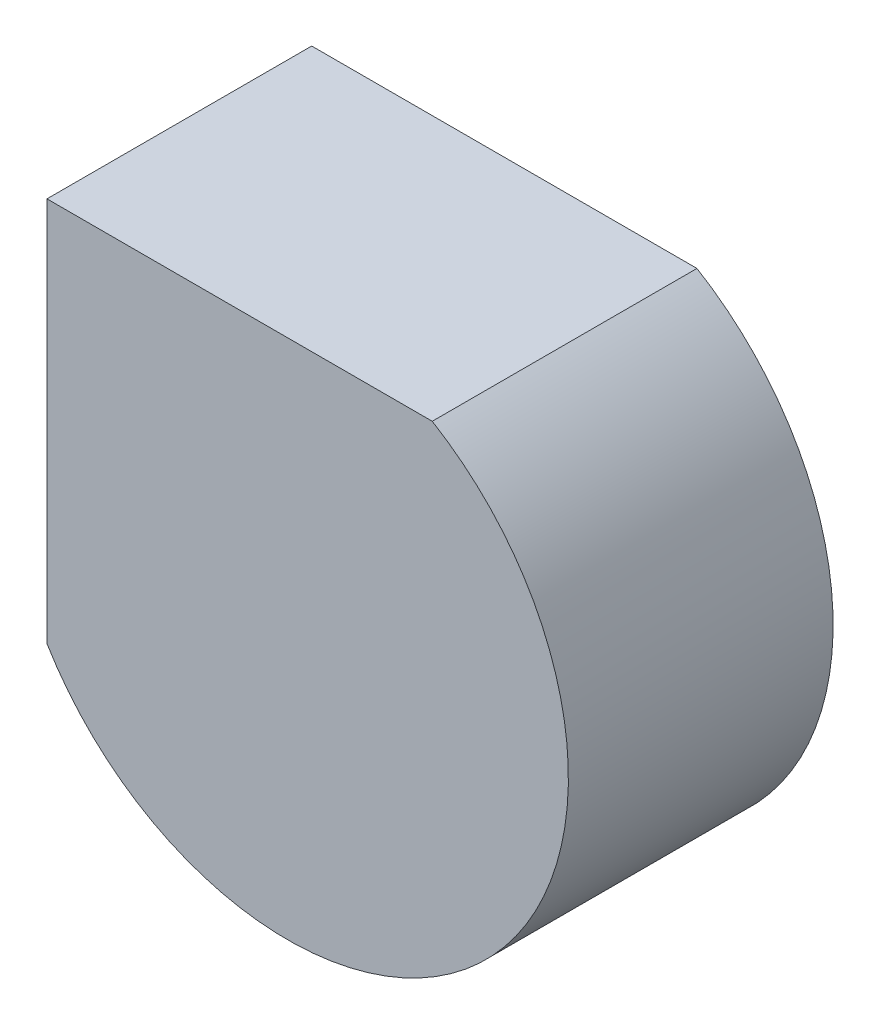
ISO-10303-21;
HEADER;
FILE_DESCRIPTION(('STEP AP214'),'2;1');
FILE_NAME('part.step','',(''),(''),'','','');
FILE_SCHEMA(('AUTOMOTIVE_DESIGN { 1 0 10303 214 1 1 1 1 }'));
ENDSEC;
DATA;
#1=APPLICATION_CONTEXT('core data for automotive mechanical design processes');
#2=APPLICATION_PROTOCOL_DEFINITION('international standard','automotive_design',2000,#1);
#3=PRODUCT_CONTEXT('',#1,'mechanical');
#4=PRODUCT('Part','Part','',(#3));
#5=PRODUCT_RELATED_PRODUCT_CATEGORY('part','',(#4));
#6=PRODUCT_DEFINITION_FORMATION('','',#4);
#7=PRODUCT_DEFINITION_CONTEXT('part definition',#1,'design');
#8=PRODUCT_DEFINITION('design','',#6,#7);
#9=PRODUCT_DEFINITION_SHAPE('','',#8);
#10=(LENGTH_UNIT() NAMED_UNIT(*) SI_UNIT(.MILLI.,.METRE.));
#11=(NAMED_UNIT(*) PLANE_ANGLE_UNIT() SI_UNIT($,.RADIAN.));
#12=(NAMED_UNIT(*) SI_UNIT($,.STERADIAN.) SOLID_ANGLE_UNIT());
#13=UNCERTAINTY_MEASURE_WITH_UNIT(LENGTH_MEASURE(1.E-05),#10,'distance_accuracy_value','');
#14=(GEOMETRIC_REPRESENTATION_CONTEXT(3) GLOBAL_UNCERTAINTY_ASSIGNED_CONTEXT((#13)) GLOBAL_UNIT_ASSIGNED_CONTEXT((#10,
#11,#12)) REPRESENTATION_CONTEXT('',''));
#15=CARTESIAN_POINT('',(0.,0.,0.));
#16=DIRECTION('',(0.,0.,1.));
#17=DIRECTION('',(1.,0.,0.));
#18=AXIS2_PLACEMENT_3D('',#15,#16,#17);
#19=CARTESIAN_POINT('',(0.,0.,0.));
#20=DIRECTION('',(0.,0.,-1.));
#21=DIRECTION('',(-1.,0.,0.));
#22=AXIS2_PLACEMENT_3D('',#19,#20,#21);
#23=CONICAL_SURFACE('',#22,25.,0.0349065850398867);
#24=CARTESIAN_POINT('',(0.,0.,-0.1930201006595));
#25=DIRECTION('',(0.,0.,-1.));
#26=DIRECTION('',(-1.,0.,0.));
#27=AXIS2_PLACEMENT_3D('',#24,#25,#26);
#28=CIRCLE('',#27,25.0067404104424);
#29=CARTESIAN_POINT('',(-25.0067404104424,0.,-0.1930201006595));
#30=VERTEX_POINT('',#29);
#31=EDGE_CURVE('E166',#30,#30,#28,.F.);
#32=ORIENTED_EDGE('',*,*,#31,.T.);
#33=EDGE_LOOP('',(#32));
#34=FACE_BOUND('',#33,.T.);
#35=CARTESIAN_POINT('',(0.,0.,-3.));
#36=DIRECTION('',(0.,0.,-1.));
#37=DIRECTION('',(-1.,0.,0.));
#38=AXIS2_PLACEMENT_3D('',#35,#36,#37);
#39=CIRCLE('',#38,25.1047623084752);
#40=CARTESIAN_POINT('',(13.1531404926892,21.3832641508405,-3.));
#41=VERTEX_POINT('',#40);
#42=CARTESIAN_POINT('',(24.1239990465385,6.9485077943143,-3.));
#43=VERTEX_POINT('',#42);
#44=EDGE_CURVE('E84',#41,#43,#39,.F.);
#45=ORIENTED_EDGE('',*,*,#44,.F.);
#46=CARTESIAN_POINT('',(11.682794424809,22.2207426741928,-3.));
#47=CARTESIAN_POINT('',(11.746621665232,22.1880879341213,-3.02286542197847));
#48=CARTESIAN_POINT('',(11.8109198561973,22.1547574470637,-3.04372447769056));
#49=CARTESIAN_POINT('',(11.9404029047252,22.0866946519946,-3.08033358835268));
#50=CARTESIAN_POINT('',(12.0055894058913,22.0519594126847,-3.09607226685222));
#51=CARTESIAN_POINT('',(12.134684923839,21.9821680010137,-3.1208825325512));
#52=CARTESIAN_POINT('',(12.1985788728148,21.9471477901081,-3.13012780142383));
#53=CARTESIAN_POINT('',(12.326362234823,21.876106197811,-3.14188607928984));
#54=CARTESIAN_POINT('',(12.3902515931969,21.8400858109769,-3.1444055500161));
#55=CARTESIAN_POINT('',(12.5183707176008,21.7668294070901,-3.14248914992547));
#56=CARTESIAN_POINT('',(12.5825934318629,21.7295835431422,-3.1379589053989));
#57=CARTESIAN_POINT('',(12.709972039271,21.6546854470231,-3.12217638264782));
#58=CARTESIAN_POINT('',(12.7731275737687,21.6170330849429,-3.11092188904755));
#59=CARTESIAN_POINT('',(12.8985857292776,21.5412535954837,-3.08246866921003));
#60=CARTESIAN_POINT('',(12.960875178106,21.5031252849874,-3.06521626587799));
#61=CARTESIAN_POINT('',(13.083879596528,21.4268965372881,-3.02593826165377));
#62=CARTESIAN_POINT('',(13.1445951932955,21.38879609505,-3.00391459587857));
#63=CARTESIAN_POINT('',(13.3311290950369,21.2703912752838,-2.92981694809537));
#64=CARTESIAN_POINT('',(13.4544645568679,21.1901470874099,-2.87150602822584));
#65=CARTESIAN_POINT('',(13.6968859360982,21.0290870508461,-2.74723216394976));
#66=CARTESIAN_POINT('',(13.8159651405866,20.9482705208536,-2.6812577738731));
#67=CARTESIAN_POINT('',(14.0523537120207,20.7847766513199,-2.54688866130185));
#68=CARTESIAN_POINT('',(14.1696534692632,20.7020928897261,-2.47848488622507));
#69=CARTESIAN_POINT('',(14.4033903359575,20.5343915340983,-2.34332399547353));
#70=CARTESIAN_POINT('',(14.5198279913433,20.4493756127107,-2.2765657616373));
#71=CARTESIAN_POINT('',(14.751890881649,20.2770428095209,-2.14796696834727));
#72=CARTESIAN_POINT('',(14.8675144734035,20.1897520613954,-2.08608899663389));
#73=CARTESIAN_POINT('',(15.0994888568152,20.0117247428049,-1.96879740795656));
#74=CARTESIAN_POINT('',(15.2158398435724,19.9209872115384,-1.91338561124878));
#75=CARTESIAN_POINT('',(15.4490249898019,19.7361589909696,-1.81112098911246));
#76=CARTESIAN_POINT('',(15.5658565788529,19.6420794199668,-1.76424247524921));
#77=CARTESIAN_POINT('',(15.8001523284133,19.4503436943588,-1.68058098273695));
#78=CARTESIAN_POINT('',(15.9176161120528,19.3526895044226,-1.64379255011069));
#79=CARTESIAN_POINT('',(16.1032411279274,19.1958703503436,-1.59490584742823));
#80=CARTESIAN_POINT('',(16.171333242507,19.1378151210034,-1.57893421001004));
#81=CARTESIAN_POINT('',(16.3074864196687,19.0206542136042,-1.55116889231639));
#82=CARTESIAN_POINT('',(16.3755474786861,18.9615484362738,-1.53937560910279));
#83=CARTESIAN_POINT('',(16.5129248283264,18.8411432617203,-1.52003372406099));
#84=CARTESIAN_POINT('',(16.5822371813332,18.7798239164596,-1.51258029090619));
#85=CARTESIAN_POINT('',(16.7205022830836,18.6563582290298,-1.50256038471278));
#86=CARTESIAN_POINT('',(16.7894549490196,18.5942117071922,-1.49999499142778));
#87=CARTESIAN_POINT('',(16.8581285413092,18.531737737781,-1.5));
#88=B_SPLINE_CURVE_WITH_KNOTS('',3,(#46,#47,#48,#49,#50,#51,#52,#53,#54,#55,#56,#57,#58,#59,#60,
#61,#62,#63,#64,#65,#66,#67,#68,#69,#70,#71,#72,#73,#74,#75,#76,#77,#78,#79,#80,#81,#82,#83,#84,
#85,#86,#87),.UNSPECIFIED.,.F.,.F.,(4,2,2,2,2,2,2,2,2,2,2,2,2,2,2,2,2,2,2,2,4),(0.,
0.225856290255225,0.452211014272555,0.672253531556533,0.892084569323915,1.11488387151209,
1.337756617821,1.56267756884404,1.78750746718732,2.26170212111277,2.7366143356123,
3.21353416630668,3.69012045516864,4.16260080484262,4.63521384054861,5.10637971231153,
5.57729040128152,5.8498898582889,6.12251521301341,6.40091339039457,6.67937305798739),.UNSPECIFIED.);
#89=CARTESIAN_POINT('',(16.8581285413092,18.531737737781,-1.5));
#90=VERTEX_POINT('',#89);
#91=EDGE_CURVE('E79',#41,#90,#88,.T.);
#92=ORIENTED_EDGE('',*,*,#91,.T.);
#93=CARTESIAN_POINT('',(0.,0.,-1.5));
#94=DIRECTION('',(0.,0.,-1.));
#95=DIRECTION('',(-1.,0.,0.));
#96=AXIS2_PLACEMENT_3D('',#93,#94,#95);
#97=CIRCLE('',#96,25.0523811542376);
#98=CARTESIAN_POINT('',(22.3684212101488,11.2816458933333,-1.5));
#99=VERTEX_POINT('',#98);
#100=EDGE_CURVE('E81',#99,#90,#97,.F.);
#101=ORIENTED_EDGE('',*,*,#100,.F.);
#102=CARTESIAN_POINT('',(21.9629374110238,12.05780533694,-1.5797166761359));
#103=CARTESIAN_POINT('',(22.0193579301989,11.9534413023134,-1.55751131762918));
#104=CARTESIAN_POINT('',(22.0755840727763,11.8479968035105,-1.5400859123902));
#105=CARTESIAN_POINT('',(22.187210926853,11.635679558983,-1.51445692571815));
#106=CARTESIAN_POINT('',(22.2426123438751,11.5288082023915,-1.50624495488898));
#107=CARTESIAN_POINT('',(22.3512303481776,11.3161876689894,-1.4987365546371));
#108=CARTESIAN_POINT('',(22.404468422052,11.2104549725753,-1.49927599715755));
#109=CARTESIAN_POINT('',(22.5095615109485,10.9986431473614,-1.50841620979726));
#110=CARTESIAN_POINT('',(22.5614162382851,10.8925639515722,-1.51701864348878));
#111=CARTESIAN_POINT('',(22.6916178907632,10.6221719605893,-1.54858778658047));
#112=CARTESIAN_POINT('',(22.7688469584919,10.4579244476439,-1.57685301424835));
#113=CARTESIAN_POINT('',(22.9189654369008,10.1309670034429,-1.64929594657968));
#114=CARTESIAN_POINT('',(22.9918527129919,9.9682578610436,-1.69348140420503));
#115=CARTESIAN_POINT('',(23.1340449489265,9.64300364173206,-1.79589167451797));
#116=CARTESIAN_POINT('',(23.2032899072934,9.48048909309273,-1.85429414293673));
#117=CARTESIAN_POINT('',(23.3372599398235,9.15794950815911,-1.98188353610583));
#118=CARTESIAN_POINT('',(23.4019855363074,8.99792418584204,-2.05106921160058));
#119=CARTESIAN_POINT('',(23.5267127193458,8.68119522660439,-2.19625490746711));
#120=CARTESIAN_POINT('',(23.5867522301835,8.52447458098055,-2.27218651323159));
#121=CARTESIAN_POINT('',(23.6741520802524,8.28969321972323,-2.38859651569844));
#122=CARTESIAN_POINT('',(23.7028406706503,8.21148685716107,-2.42781646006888));
#123=CARTESIAN_POINT('',(23.7594143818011,8.05488690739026,-2.50646191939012));
#124=CARTESIAN_POINT('',(23.7872995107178,7.9764933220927,-2.5458874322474));
#125=CARTESIAN_POINT('',(23.841762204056,7.8208636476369,-2.62336249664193));
#126=CARTESIAN_POINT('',(23.8683549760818,7.74363861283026,-2.66142344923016));
#127=CARTESIAN_POINT('',(23.9209217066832,7.58832960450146,-2.73613457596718));
#128=CARTESIAN_POINT('',(23.9468958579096,7.51024590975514,-2.77278519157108));
#129=CARTESIAN_POINT('',(23.9983392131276,7.35265725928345,-2.84364020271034));
#130=CARTESIAN_POINT('',(24.0238077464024,7.27315065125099,-2.87784148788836));
#131=CARTESIAN_POINT('',(24.0742646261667,7.11229572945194,-2.94228392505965));
#132=CARTESIAN_POINT('',(24.0992523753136,7.03094536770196,-2.9725203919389));
#133=CARTESIAN_POINT('',(24.1239990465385,6.9485077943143,-3.));
#134=B_SPLINE_CURVE_WITH_KNOTS('',3,(#102,#103,#104,#105,#106,#107,#108,#109,#110,#111,#112,
#113,#114,#115,#116,#117,#118,#119,#120,#121,#122,#123,#124,#125,#126,#127,#128,#129,#130,#131,
#132,#133),.UNSPECIFIED.,.F.,.F.,(4,2,2,2,2,2,2,2,2,2,2,2,2,2,2,4),(0.,0.361945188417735,
0.723560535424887,1.0784019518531,1.4333165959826,1.98346346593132,2.53387861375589,
3.0915607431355,3.64917831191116,4.20167498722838,4.47789390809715,4.7541100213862,
5.02442471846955,5.29465410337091,5.56522077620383,5.83610434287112),.UNSPECIFIED.);
#135=EDGE_CURVE('E88',#99,#43,#134,.T.);
#136=ORIENTED_EDGE('',*,*,#135,.T.);
#137=EDGE_LOOP('',(#45,#92,#101,#136));
#138=FACE_BOUND('',#137,.T.);
#139=ADVANCED_FACE('F44',(#34,#138),#23,.F.);
#140=CARTESIAN_POINT('',(0.,0.,0.));
#141=DIRECTION('',(0.,0.,1.));
#142=DIRECTION('',(1.,0.,0.));
#143=AXIS2_PLACEMENT_3D('',#140,#141,#142);
#144=PLANE('',#143);
#145=CARTESIAN_POINT('',(-12.0208152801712,-12.0208152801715,0.));
#146=DIRECTION('',(0.,0.,1.));
#147=DIRECTION('',(1.,0.,0.));
#148=AXIS2_PLACEMENT_3D('',#145,#146,#147);
#149=CIRCLE('',#148,3.04138126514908);
#150=CARTESIAN_POINT('',(-8.97943401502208,-12.0208152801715,0.));
#151=VERTEX_POINT('',#150);
#152=EDGE_CURVE('E53',#151,#151,#149,.T.);
#153=ORIENTED_EDGE('',*,*,#152,.T.);
#154=EDGE_LOOP('',(#153));
#155=FACE_BOUND('',#154,.T.);
#156=CARTESIAN_POINT('',(-17.,-1.78065548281E-13,0.));
#157=DIRECTION('',(0.,0.,1.));
#158=DIRECTION('',(1.,0.,0.));
#159=AXIS2_PLACEMENT_3D('',#156,#157,#158);
#160=CIRCLE('',#159,3.04138126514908);
#161=CARTESIAN_POINT('',(-13.9586187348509,-1.78065548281E-13,0.));
#162=VERTEX_POINT('',#161);
#163=EDGE_CURVE('E205',#162,#162,#160,.T.);
#164=ORIENTED_EDGE('',*,*,#163,.T.);
#165=EDGE_LOOP('',(#164));
#166=FACE_BOUND('',#165,.T.);
#167=CARTESIAN_POINT('',(-12.0208152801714,12.0208152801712,0.));
#168=DIRECTION('',(0.,0.,1.));
#169=DIRECTION('',(1.,0.,0.));
#170=AXIS2_PLACEMENT_3D('',#167,#168,#169);
#171=CIRCLE('',#170,3.04138126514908);
#172=CARTESIAN_POINT('',(-8.97943401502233,12.0208152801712,0.));
#173=VERTEX_POINT('',#172);
#174=EDGE_CURVE('E199',#173,#173,#171,.T.);
#175=ORIENTED_EDGE('',*,*,#174,.T.);
#176=EDGE_LOOP('',(#175));
#177=FACE_BOUND('',#176,.T.);
#178=CARTESIAN_POINT('',(12.0208152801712,12.0208152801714,0.));
#179=DIRECTION('',(0.,0.,1.));
#180=DIRECTION('',(1.,0.,0.));
#181=AXIS2_PLACEMENT_3D('',#178,#179,#180);
#182=CIRCLE('',#181,3.04138126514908);
#183=CARTESIAN_POINT('',(15.0621965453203,12.0208152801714,0.));
#184=VERTEX_POINT('',#183);
#185=EDGE_CURVE('E193',#184,#184,#182,.T.);
#186=ORIENTED_EDGE('',*,*,#185,.T.);
#187=EDGE_LOOP('',(#186));
#188=FACE_BOUND('',#187,.T.);
#189=CARTESIAN_POINT('',(17.,0.,0.));
#190=DIRECTION('',(0.,0.,1.));
#191=DIRECTION('',(1.,0.,0.));
#192=AXIS2_PLACEMENT_3D('',#189,#190,#191);
#193=CIRCLE('',#192,3.04138126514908);
#194=CARTESIAN_POINT('',(20.0413812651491,0.,0.));
#195=VERTEX_POINT('',#194);
#196=EDGE_CURVE('E187',#195,#195,#193,.T.);
#197=ORIENTED_EDGE('',*,*,#196,.T.);
#198=EDGE_LOOP('',(#197));
#199=FACE_BOUND('',#198,.T.);
#200=CARTESIAN_POINT('',(12.0208152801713,-12.0208152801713,0.));
#201=DIRECTION('',(0.,0.,1.));
#202=DIRECTION('',(1.,0.,0.));
#203=AXIS2_PLACEMENT_3D('',#200,#201,#202);
#204=CIRCLE('',#203,3.04138126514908);
#205=CARTESIAN_POINT('',(15.0621965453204,-12.0208152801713,0.));
#206=VERTEX_POINT('',#205);
#207=EDGE_CURVE('E181',#206,#206,#204,.T.);
#208=ORIENTED_EDGE('',*,*,#207,.T.);
#209=EDGE_LOOP('',(#208));
#210=FACE_BOUND('',#209,.T.);
#211=CARTESIAN_POINT('',(0.,-17.,0.));
#212=DIRECTION('',(0.,0.,1.));
#213=DIRECTION('',(1.,0.,0.));
#214=AXIS2_PLACEMENT_3D('',#211,#212,#213);
#215=CIRCLE('',#214,3.04138126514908);
#216=CARTESIAN_POINT('',(3.04138126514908,-17.,0.));
#217=VERTEX_POINT('',#216);
#218=EDGE_CURVE('E175',#217,#217,#215,.T.);
#219=ORIENTED_EDGE('',*,*,#218,.T.);
#220=EDGE_LOOP('',(#219));
#221=FACE_BOUND('',#220,.T.);
#222=CARTESIAN_POINT('',(0.,0.,0.));
#223=DIRECTION('',(0.,0.,1.));
#224=DIRECTION('',(1.,0.,0.));
#225=AXIS2_PLACEMENT_3D('',#222,#223,#224);
#226=CIRCLE('',#225,24.8068622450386);
#227=CARTESIAN_POINT('',(24.8068622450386,0.,0.));
#228=VERTEX_POINT('',#227);
#229=EDGE_CURVE('E172',#228,#228,#226,.F.);
#230=ORIENTED_EDGE('',*,*,#229,.T.);
#231=EDGE_LOOP('',(#230));
#232=FACE_BOUND('',#231,.T.);
#233=CARTESIAN_POINT('',(0.,17.,0.));
#234=DIRECTION('',(0.,0.,1.));
#235=DIRECTION('',(1.,0.,0.));
#236=AXIS2_PLACEMENT_3D('',#233,#234,#235);
#237=CIRCLE('',#236,5.04313775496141);
#238=CARTESIAN_POINT('',(5.04313775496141,17.,0.));
#239=VERTEX_POINT('',#238);
#240=EDGE_CURVE('E169',#239,#239,#237,.T.);
#241=ORIENTED_EDGE('',*,*,#240,.T.);
#242=EDGE_LOOP('',(#241));
#243=FACE_BOUND('',#242,.T.);
#244=CARTESIAN_POINT('',(0.,0.,0.));
#245=DIRECTION('',(0.,0.,1.));
#246=DIRECTION('',(1.,0.,0.));
#247=AXIS2_PLACEMENT_3D('',#244,#245,#246);
#248=CIRCLE('',#247,11.9313775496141);
#249=CARTESIAN_POINT('',(11.9313775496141,0.,0.));
#250=VERTEX_POINT('',#249);
#251=EDGE_CURVE('E148',#250,#250,#248,.T.);
#252=ORIENTED_EDGE('',*,*,#251,.T.);
#253=EDGE_LOOP('',(#252));
#254=FACE_BOUND('',#253,.T.);
#255=ADVANCED_FACE('F137',(#155,#166,#177,#188,#199,#210,#221,#232,#243,#254),#144,.F.);
#256=CARTESIAN_POINT('',(0.,0.,0.));
#257=DIRECTION('',(0.,0.,1.));
#258=DIRECTION('',(-1.,0.,0.));
#259=AXIS2_PLACEMENT_3D('',#256,#257,#258);
#260=CONICAL_SURFACE('',#259,10.,0.0349065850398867);
#261=CARTESIAN_POINT('',(0.,0.,-1.930201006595));
#262=DIRECTION('',(0.,0.,1.));
#263=DIRECTION('',(1.,0.,0.));
#264=AXIS2_PLACEMENT_3D('',#261,#262,#263);
#265=CIRCLE('',#264,9.93259589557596);
#266=CARTESIAN_POINT('',(9.93259589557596,0.,-1.930201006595));
#267=VERTEX_POINT('',#266);
#268=EDGE_CURVE('E121',#267,#267,#265,.F.);
#269=ORIENTED_EDGE('',*,*,#268,.T.);
#270=EDGE_LOOP('',(#269));
#271=FACE_BOUND('',#270,.T.);
#272=CARTESIAN_POINT('',(0.,0.,-5.));
#273=DIRECTION('',(0.,0.,-1.));
#274=DIRECTION('',(-1.,0.,0.));
#275=AXIS2_PLACEMENT_3D('',#272,#273,#274);
#276=CIRCLE('',#275,9.82539615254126);
#277=CARTESIAN_POINT('',(-9.82539615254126,0.,-5.));
#278=VERTEX_POINT('',#277);
#279=EDGE_CURVE('E109',#278,#278,#276,.T.);
#280=ORIENTED_EDGE('',*,*,#279,.F.);
#281=EDGE_LOOP('',(#280));
#282=FACE_BOUND('',#281,.T.);
#283=ADVANCED_FACE('F233',(#271,#282),#260,.T.);
#284=CARTESIAN_POINT('',(0.,0.,-5.));
#285=DIRECTION('',(0.,0.,-1.));
#286=DIRECTION('',(-1.,0.,0.));
#287=AXIS2_PLACEMENT_3D('',#284,#285,#286);
#288=PLANE('',#287);
#289=ORIENTED_EDGE('',*,*,#279,.T.);
#290=EDGE_LOOP('',(#289));
#291=FACE_BOUND('',#290,.T.);
#292=ADVANCED_FACE('F302',(#291),#288,.T.);
#293=CARTESIAN_POINT('',(0.,17.,1.5));
#294=DIRECTION('',(0.,0.,1.));
#295=DIRECTION('',(1.,0.,0.));
#296=AXIS2_PLACEMENT_3D('',#293,#294,#295);
#297=PLANE('',#296);
#298=CARTESIAN_POINT('',(0.,17.,1.5));
#299=DIRECTION('',(0.,0.,1.));
#300=DIRECTION('',(1.,0.,0.));
#301=AXIS2_PLACEMENT_3D('',#298,#299,#300);
#302=CIRCLE('',#301,1.99551890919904);
#303=CARTESIAN_POINT('',(1.99551890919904,17.,1.5));
#304=VERTEX_POINT('',#303);
#305=EDGE_CURVE('E154',#304,#304,#302,.T.);
#306=ORIENTED_EDGE('',*,*,#305,.T.);
#307=EDGE_LOOP('',(#306));
#308=FACE_BOUND('',#307,.T.);
#309=CARTESIAN_POINT('',(0.,17.,1.5));
#310=DIRECTION('',(0.,0.,1.));
#311=DIRECTION('',(1.,0.,0.));
#312=AXIS2_PLACEMENT_3D('',#309,#310,#311);
#313=CIRCLE('',#312,4.60448109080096);
#314=CARTESIAN_POINT('',(4.60448109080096,17.,1.5));
#315=VERTEX_POINT('',#314);
#316=EDGE_CURVE('E151',#315,#315,#313,.F.);
#317=ORIENTED_EDGE('',*,*,#316,.T.);
#318=EDGE_LOOP('',(#317));
#319=FACE_BOUND('',#318,.T.);
#320=ADVANCED_FACE('F307',(#308,#319),#297,.F.);
#321=CARTESIAN_POINT('',(0.,17.,0.));
#322=DIRECTION('',(0.,0.,-1.));
#323=DIRECTION('',(-1.,0.,0.));
#324=AXIS2_PLACEMENT_3D('',#321,#322,#323);
#325=CONICAL_SURFACE('',#324,4.85,0.0349065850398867);
#326=CARTESIAN_POINT('',(0.,17.,1.3069798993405));
#327=DIRECTION('',(0.,0.,1.));
#328=DIRECTION('',(1.,0.,0.));
#329=AXIS2_PLACEMENT_3D('',#326,#327,#328);
#330=CIRCLE('',#329,4.80435925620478);
#331=CARTESIAN_POINT('',(4.80435925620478,17.,1.3069798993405));
#332=VERTEX_POINT('',#331);
#333=EDGE_CURVE('E163',#332,#332,#330,.T.);
#334=ORIENTED_EDGE('',*,*,#333,.T.);
#335=EDGE_LOOP('',(#334));
#336=FACE_BOUND('',#335,.T.);
#337=CARTESIAN_POINT('',(0.,17.,0.1930201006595));
#338=DIRECTION('',(0.,0.,-1.));
#339=DIRECTION('',(-1.,0.,0.));
#340=AXIS2_PLACEMENT_3D('',#337,#338,#339);
#341=CIRCLE('',#340,4.8432595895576);
#342=CARTESIAN_POINT('',(-4.8432595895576,17.,0.1930201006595));
#343=VERTEX_POINT('',#342);
#344=EDGE_CURVE('E160',#343,#343,#341,.T.);
#345=ORIENTED_EDGE('',*,*,#344,.T.);
#346=EDGE_LOOP('',(#345));
#347=FACE_BOUND('',#346,.T.);
#348=ADVANCED_FACE('F311',(#336,#347),#325,.F.);
#349=CARTESIAN_POINT('',(0.,17.,0.));
#350=DIRECTION('',(0.,0.,1.));
#351=DIRECTION('',(-1.,0.,0.));
#352=AXIS2_PLACEMENT_3D('',#349,#350,#351);
#353=CONICAL_SURFACE('',#352,1.75,0.0349065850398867);
#354=CARTESIAN_POINT('',(0.,17.,1.3069798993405));
#355=DIRECTION('',(0.,0.,1.));
#356=DIRECTION('',(1.,0.,0.));
#357=AXIS2_PLACEMENT_3D('',#354,#355,#356);
#358=CIRCLE('',#357,1.79564074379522);
#359=CARTESIAN_POINT('',(1.79564074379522,17.,1.3069798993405));
#360=VERTEX_POINT('',#359);
#361=EDGE_CURVE('E157',#360,#360,#358,.F.);
#362=ORIENTED_EDGE('',*,*,#361,.T.);
#363=EDGE_LOOP('',(#362));
#364=FACE_BOUND('',#363,.T.);
#365=CARTESIAN_POINT('',(0.,17.,-5.));
#366=DIRECTION('',(0.,0.,-1.));
#367=DIRECTION('',(-1.,0.,0.));
#368=AXIS2_PLACEMENT_3D('',#365,#366,#367);
#369=CIRCLE('',#368,1.57539615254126);
#370=CARTESIAN_POINT('',(-1.57539615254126,17.,-5.));
#371=VERTEX_POINT('',#370);
#372=EDGE_CURVE('E112',#371,#371,#369,.F.);
#373=ORIENTED_EDGE('',*,*,#372,.T.);
#374=EDGE_LOOP('',(#373));
#375=FACE_BOUND('',#374,.T.);
#376=ADVANCED_FACE('F319',(#364,#375),#353,.T.);
#377=CARTESIAN_POINT('',(0.,0.,-5.));
#378=DIRECTION('',(0.,0.,-1.));
#379=DIRECTION('',(-1.,0.,0.));
#380=AXIS2_PLACEMENT_3D('',#377,#378,#379);
#381=PLANE('',#380);
#382=ORIENTED_EDGE('',*,*,#372,.F.);
#383=EDGE_LOOP('',(#382));
#384=FACE_BOUND('',#383,.T.);
#385=ADVANCED_FACE('F315',(#384),#381,.T.);
#386=CARTESIAN_POINT('',(0.,0.,-3.));
#387=DIRECTION('',(0.,0.,-1.));
#388=DIRECTION('',(-1.,0.,0.));
#389=AXIS2_PLACEMENT_3D('',#386,#387,#388);
#390=PLANE('',#389);
#391=CARTESIAN_POINT('',(19.9037600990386,15.1274695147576,-3.));
#392=DIRECTION('',(0.,0.,-1.));
#393=DIRECTION('',(-1.,0.,0.));
#394=AXIS2_PLACEMENT_3D('',#391,#392,#393);
#395=CIRCLE('',#394,7.5);
#396=CARTESIAN_POINT('',(16.2836234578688,21.6959252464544,-3.));
#397=VERTEX_POINT('',#396);
#398=CARTESIAN_POINT('',(25.2633122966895,9.88102307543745,-3.));
#399=VERTEX_POINT('',#398);
#400=EDGE_CURVE('E108',#397,#399,#395,.T.);
#401=ORIENTED_EDGE('',*,*,#400,.F.);
#402=CARTESIAN_POINT('',(14.3528839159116,25.1991016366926,-3.));
#403=DIRECTION('',(0.,0.,-1.));
#404=DIRECTION('',(-1.,0.,0.));
#405=AXIS2_PLACEMENT_3D('',#402,#403,#404);
#406=CIRCLE('',#405,4.);
#407=EDGE_CURVE('E644',#397,#41,#406,.T.);
#408=ORIENTED_EDGE('',*,*,#407,.T.);
#409=ORIENTED_EDGE('',*,*,#44,.T.);
#410=CARTESIAN_POINT('',(28.1217401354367,7.08291830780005,-3.));
#411=DIRECTION('',(0.,0.,-1.));
#412=DIRECTION('',(-1.,0.,0.));
#413=AXIS2_PLACEMENT_3D('',#410,#411,#412);
#414=CIRCLE('',#413,4.);
#415=EDGE_CURVE('E93',#43,#399,#414,.T.);
#416=ORIENTED_EDGE('',*,*,#415,.T.);
#417=EDGE_LOOP('',(#401,#408,#409,#416));
#418=FACE_BOUND('',#417,.T.);
#419=CARTESIAN_POINT('',(0.,0.,-3.));
#420=DIRECTION('',(0.,0.,-1.));
#421=DIRECTION('',(-1.,0.,0.));
#422=AXIS2_PLACEMENT_3D('',#419,#420,#421);
#423=CIRCLE('',#422,35.);
#424=CARTESIAN_POINT('',(18.02775637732,30.,-3.));
#425=VERTEX_POINT('',#424);
#426=CARTESIAN_POINT('',(-30.,-18.02775637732,-3.));
#427=VERTEX_POINT('',#426);
#428=EDGE_CURVE('E621',#425,#427,#423,.T.);
#429=ORIENTED_EDGE('',*,*,#428,.T.);
#430=DIRECTION('',(0.,-1.,0.));
#431=VECTOR('',#430,1.);
#432=CARTESIAN_POINT('',(-30.,30.,-3.));
#433=LINE('',#432,#431);
#434=CARTESIAN_POINT('',(-30.,30.,-3.));
#435=VERTEX_POINT('',#434);
#436=EDGE_CURVE('E94',#435,#427,#433,.T.);
#437=ORIENTED_EDGE('',*,*,#436,.F.);
#438=DIRECTION('',(-1.,0.,0.));
#439=VECTOR('',#438,1.);
#440=CARTESIAN_POINT('',(-30.,30.,-3.));
#441=LINE('',#440,#439);
#442=EDGE_CURVE('E115',#425,#435,#441,.T.);
#443=ORIENTED_EDGE('',*,*,#442,.F.);
#444=EDGE_LOOP('',(#429,#437,#443));
#445=FACE_BOUND('',#444,.T.);
#446=ADVANCED_FACE('F318',(#418,#445),#390,.T.);
#447=CARTESIAN_POINT('',(0.,0.,30.));
#448=DIRECTION('',(0.,0.,1.));
#449=DIRECTION('',(1.,0.,0.));
#450=AXIS2_PLACEMENT_3D('',#447,#448,#449);
#451=PLANE('',#450);
#452=CARTESIAN_POINT('',(0.,0.,30.));
#453=DIRECTION('',(0.,0.,1.));
#454=DIRECTION('',(-1.,0.,0.));
#455=AXIS2_PLACEMENT_3D('',#452,#453,#454);
#456=CIRCLE('',#455,35.);
#457=CARTESIAN_POINT('',(-30.,-18.02775637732,30.));
#458=VERTEX_POINT('',#457);
#459=CARTESIAN_POINT('',(18.0277563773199,30.,30.));
#460=VERTEX_POINT('',#459);
#461=EDGE_CURVE('E656',#458,#460,#456,.T.);
#462=ORIENTED_EDGE('',*,*,#461,.T.);
#463=DIRECTION('',(1.,0.,0.));
#464=VECTOR('',#463,1.);
#465=CARTESIAN_POINT('',(0.,30.,30.));
#466=LINE('',#465,#464);
#467=CARTESIAN_POINT('',(-30.,30.,30.));
#468=VERTEX_POINT('',#467);
#469=EDGE_CURVE('E114',#468,#460,#466,.T.);
#470=ORIENTED_EDGE('',*,*,#469,.F.);
#471=DIRECTION('',(0.,-1.,0.));
#472=VECTOR('',#471,1.);
#473=CARTESIAN_POINT('',(-30.,0.,30.));
#474=LINE('',#473,#472);
#475=EDGE_CURVE('E665',#468,#458,#474,.T.);
#476=ORIENTED_EDGE('',*,*,#475,.T.);
#477=EDGE_LOOP('',(#462,#470,#476));
#478=FACE_BOUND('',#477,.T.);
#479=ADVANCED_FACE('F325',(#478),#451,.T.);
#480=CARTESIAN_POINT('',(-30.,30.,-180.66048165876));
#481=DIRECTION('',(-1.,0.,0.));
#482=DIRECTION('',(0.,-1.,0.));
#483=AXIS2_PLACEMENT_3D('',#480,#481,#482);
#484=PLANE('',#483);
#485=DIRECTION('',(0.,0.,-1.));
#486=VECTOR('',#485,1.);
#487=CARTESIAN_POINT('',(-30.,-18.02775637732,30.));
#488=LINE('',#487,#486);
#489=EDGE_CURVE('E636',#458,#427,#488,.T.);
#490=ORIENTED_EDGE('',*,*,#489,.F.);
#491=ORIENTED_EDGE('',*,*,#475,.F.);
#492=DIRECTION('',(0.,0.,1.));
#493=VECTOR('',#492,1.);
#494=CARTESIAN_POINT('',(-30.,30.,-180.66048165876));
#495=LINE('',#494,#493);
#496=EDGE_CURVE('E145',#435,#468,#495,.T.);
#497=ORIENTED_EDGE('',*,*,#496,.F.);
#498=ORIENTED_EDGE('',*,*,#436,.T.);
#499=EDGE_LOOP('',(#490,#491,#497,#498));
#500=FACE_BOUND('',#499,.T.);
#501=ADVANCED_FACE('F321',(#500),#484,.T.);
#502=CARTESIAN_POINT('',(-30.,30.,-180.66048165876));
#503=DIRECTION('',(0.,1.,0.));
#504=DIRECTION('',(0.,0.,1.));
#505=AXIS2_PLACEMENT_3D('',#502,#503,#504);
#506=PLANE('',#505);
#507=DIRECTION('',(0.,0.,-1.));
#508=VECTOR('',#507,1.);
#509=CARTESIAN_POINT('',(18.0277563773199,30.,30.));
#510=LINE('',#509,#508);
#511=EDGE_CURVE('E105',#460,#425,#510,.T.);
#512=ORIENTED_EDGE('',*,*,#511,.T.);
#513=ORIENTED_EDGE('',*,*,#442,.T.);
#514=ORIENTED_EDGE('',*,*,#496,.T.);
#515=ORIENTED_EDGE('',*,*,#469,.T.);
#516=EDGE_LOOP('',(#512,#513,#514,#515));
#517=FACE_BOUND('',#516,.T.);
#518=ADVANCED_FACE('F324',(#517),#506,.T.);
#519=CARTESIAN_POINT('',(19.9037600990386,15.1274695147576,-1.5));
#520=DIRECTION('',(0.,0.,-1.));
#521=DIRECTION('',(-1.,0.,0.));
#522=AXIS2_PLACEMENT_3D('',#519,#520,#521);
#523=PLANE('',#522);
#524=ORIENTED_EDGE('',*,*,#100,.T.);
#525=CARTESIAN_POINT('',(14.3528839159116,25.1991016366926,-1.5));
#526=DIRECTION('',(0.,0.,-1.));
#527=DIRECTION('',(-1.,0.,0.));
#528=AXIS2_PLACEMENT_3D('',#525,#526,#527);
#529=CIRCLE('',#528,7.1224989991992);
#530=CARTESIAN_POINT('',(17.7908065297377,18.96125905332,-1.5));
#531=VERTEX_POINT('',#530);
#532=EDGE_CURVE('E89',#90,#531,#529,.F.);
#533=ORIENTED_EDGE('',*,*,#532,.T.);
#534=CARTESIAN_POINT('',(19.9037600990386,15.1274695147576,-1.5));
#535=DIRECTION('',(0.,0.,-1.));
#536=DIRECTION('',(-1.,0.,0.));
#537=AXIS2_PLACEMENT_3D('',#534,#535,#536);
#538=CIRCLE('',#537,4.3775010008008);
#539=CARTESIAN_POINT('',(23.0319527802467,12.065292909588,-1.5));
#540=VERTEX_POINT('',#539);
#541=EDGE_CURVE('E61',#531,#540,#538,.T.);
#542=ORIENTED_EDGE('',*,*,#541,.T.);
#543=CARTESIAN_POINT('',(28.1217401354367,7.08291830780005,-1.5));
#544=DIRECTION('',(0.,0.,-1.));
#545=DIRECTION('',(-1.,0.,0.));
#546=AXIS2_PLACEMENT_3D('',#543,#544,#545);
#547=CIRCLE('',#546,7.1224989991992);
#548=EDGE_CURVE('E92',#540,#99,#547,.F.);
#549=ORIENTED_EDGE('',*,*,#548,.T.);
#550=EDGE_LOOP('',(#524,#533,#542,#549));
#551=FACE_BOUND('',#550,.T.);
#552=ADVANCED_FACE('F91',(#551),#523,.T.);
#553=CARTESIAN_POINT('',(28.1217401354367,7.08291830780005,-5.5));
#554=DIRECTION('',(0.,0.,-1.));
#555=DIRECTION('',(-1.,0.,0.));
#556=AXIS2_PLACEMENT_3D('',#553,#554,#555);
#557=TOROIDAL_SURFACE('',#556,7.1224989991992,4.);
#558=ORIENTED_EDGE('',*,*,#135,.F.);
#559=ORIENTED_EDGE('',*,*,#548,.F.);
#560=CARTESIAN_POINT('',(23.0319527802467,12.065292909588,-5.5));
#561=DIRECTION('',(-0.699526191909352,-0.714606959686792,0.));
#562=DIRECTION('',(0.714606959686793,-0.699526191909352,0.));
#563=AXIS2_PLACEMENT_3D('',#560,#561,#562);
#564=CIRCLE('',#563,4.);
#565=EDGE_CURVE('E104',#399,#540,#564,.T.);
#566=ORIENTED_EDGE('',*,*,#565,.F.);
#567=ORIENTED_EDGE('',*,*,#415,.F.);
#568=EDGE_LOOP('',(#558,#559,#566,#567));
#569=FACE_BOUND('',#568,.T.);
#570=ADVANCED_FACE('F124',(#569),#557,.F.);
#571=CARTESIAN_POINT('',(19.9037600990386,15.1274695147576,-5.5));
#572=DIRECTION('',(0.,0.,1.));
#573=DIRECTION('',(1.,0.,0.));
#574=AXIS2_PLACEMENT_3D('',#571,#572,#573);
#575=TOROIDAL_SURFACE('',#574,4.3775010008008,4.);
#576=ORIENTED_EDGE('',*,*,#565,.T.);
#577=ORIENTED_EDGE('',*,*,#541,.F.);
#578=CARTESIAN_POINT('',(17.7908065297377,18.96125905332,-5.5));
#579=DIRECTION('',(0.87579409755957,0.4826848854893,0.));
#580=DIRECTION('',(-0.4826848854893,0.87579409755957,0.));
#581=AXIS2_PLACEMENT_3D('',#578,#579,#580);
#582=CIRCLE('',#581,4.);
#583=EDGE_CURVE('E98',#397,#531,#582,.T.);
#584=ORIENTED_EDGE('',*,*,#583,.F.);
#585=ORIENTED_EDGE('',*,*,#400,.T.);
#586=EDGE_LOOP('',(#576,#577,#584,#585));
#587=FACE_BOUND('',#586,.T.);
#588=ADVANCED_FACE('F128',(#587),#575,.F.);
#589=CARTESIAN_POINT('',(14.3528839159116,25.1991016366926,-5.5));
#590=DIRECTION('',(0.,0.,-1.));
#591=DIRECTION('',(-1.,0.,0.));
#592=AXIS2_PLACEMENT_3D('',#589,#590,#591);
#593=TOROIDAL_SURFACE('',#592,7.1224989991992,4.);
#594=ORIENTED_EDGE('',*,*,#91,.F.);
#595=ORIENTED_EDGE('',*,*,#407,.F.);
#596=ORIENTED_EDGE('',*,*,#583,.T.);
#597=ORIENTED_EDGE('',*,*,#532,.F.);
#598=EDGE_LOOP('',(#594,#595,#596,#597));
#599=FACE_BOUND('',#598,.T.);
#600=ADVANCED_FACE('F96',(#599),#593,.F.);
#601=CARTESIAN_POINT('',(0.,0.,-2.));
#602=DIRECTION('',(0.,0.,1.));
#603=DIRECTION('',(1.,0.,0.));
#604=AXIS2_PLACEMENT_3D('',#601,#602,#603);
#605=TOROIDAL_SURFACE('',#604,11.9313775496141,2.);
#606=ORIENTED_EDGE('',*,*,#251,.F.);
#607=EDGE_LOOP('',(#606));
#608=FACE_BOUND('',#607,.T.);
#609=ORIENTED_EDGE('',*,*,#268,.F.);
#610=EDGE_LOOP('',(#609));
#611=FACE_BOUND('',#610,.T.);
#612=ADVANCED_FACE('F136',(#608,#611),#605,.F.);
#613=CARTESIAN_POINT('',(0.,17.,1.3));
#614=DIRECTION('',(0.,0.,1.));
#615=DIRECTION('',(1.,0.,0.));
#616=AXIS2_PLACEMENT_3D('',#613,#614,#615);
#617=TOROIDAL_SURFACE('',#616,1.99551890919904,0.2);
#618=ORIENTED_EDGE('',*,*,#361,.F.);
#619=EDGE_LOOP('',(#618));
#620=FACE_BOUND('',#619,.T.);
#621=ORIENTED_EDGE('',*,*,#305,.F.);
#622=EDGE_LOOP('',(#621));
#623=FACE_BOUND('',#622,.T.);
#624=ADVANCED_FACE('F249',(#620,#623),#617,.F.);
#625=CARTESIAN_POINT('',(0.,17.,1.3));
#626=DIRECTION('',(0.,0.,1.));
#627=DIRECTION('',(1.,0.,0.));
#628=AXIS2_PLACEMENT_3D('',#625,#626,#627);
#629=TOROIDAL_SURFACE('',#628,4.60448109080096,0.2);
#630=ORIENTED_EDGE('',*,*,#316,.F.);
#631=EDGE_LOOP('',(#630));
#632=FACE_BOUND('',#631,.T.);
#633=ORIENTED_EDGE('',*,*,#333,.F.);
#634=EDGE_LOOP('',(#633));
#635=FACE_BOUND('',#634,.T.);
#636=ADVANCED_FACE('F239',(#632,#635),#629,.F.);
#637=CARTESIAN_POINT('',(0.,0.,-0.2));
#638=DIRECTION('',(0.,0.,1.));
#639=DIRECTION('',(1.,0.,0.));
#640=AXIS2_PLACEMENT_3D('',#637,#638,#639);
#641=TOROIDAL_SURFACE('',#640,24.8068622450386,0.2);
#642=ORIENTED_EDGE('',*,*,#229,.F.);
#643=EDGE_LOOP('',(#642));
#644=FACE_BOUND('',#643,.T.);
#645=ORIENTED_EDGE('',*,*,#31,.F.);
#646=EDGE_LOOP('',(#645));
#647=FACE_BOUND('',#646,.T.);
#648=ADVANCED_FACE('F236',(#644,#647),#641,.F.);
#649=CARTESIAN_POINT('',(0.,17.,0.2));
#650=DIRECTION('',(0.,0.,1.));
#651=DIRECTION('',(1.,0.,0.));
#652=AXIS2_PLACEMENT_3D('',#649,#650,#651);
#653=TOROIDAL_SURFACE('',#652,5.04313775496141,0.2);
#654=ORIENTED_EDGE('',*,*,#344,.F.);
#655=EDGE_LOOP('',(#654));
#656=FACE_BOUND('',#655,.T.);
#657=ORIENTED_EDGE('',*,*,#240,.F.);
#658=EDGE_LOOP('',(#657));
#659=FACE_BOUND('',#658,.T.);
#660=ADVANCED_FACE('F238',(#656,#659),#653,.T.);
#661=CARTESIAN_POINT('',(0.,-17.,-1.33333333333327));
#662=DIRECTION('',(0.,1.,0.));
#663=DIRECTION('',(0.,0.,-1.));
#664=AXIS2_PLACEMENT_3D('',#661,#662,#663);
#665=SPHERICAL_SURFACE('',#664,2.83333333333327);
#666=CARTESIAN_POINT('',(0.,-17.,-1.33333333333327));
#667=DIRECTION('',(0.,0.,-1.));
#668=DIRECTION('',(-1.,0.,0.));
#669=AXIS2_PLACEMENT_3D('',#666,#667,#668);
#670=SPHERICAL_SURFACE('',#669,2.83333333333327);
#671=CARTESIAN_POINT('',(0.,-17.,0.391304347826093));
#672=DIRECTION('',(0.,0.,-1.));
#673=DIRECTION('',(-1.,0.,0.));
#674=AXIS2_PLACEMENT_3D('',#671,#672,#673);
#675=CIRCLE('',#674,2.24797745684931);
#676=CARTESIAN_POINT('',(-2.24797745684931,-17.,0.391304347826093));
#677=VERTEX_POINT('',#676);
#678=EDGE_CURVE('E178',#677,#677,#675,.T.);
#679=ORIENTED_EDGE('',*,*,#678,.T.);
#680=EDGE_LOOP('',(#679));
#681=FACE_BOUND('',#680,.T.);
#682=ADVANCED_FACE('F246',(#681),#670,.F.);
#683=CARTESIAN_POINT('',(0.,-17.,1.));
#684=DIRECTION('',(0.,0.,1.));
#685=DIRECTION('',(1.,0.,0.));
#686=AXIS2_PLACEMENT_3D('',#683,#684,#685);
#687=TOROIDAL_SURFACE('',#686,3.04138126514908,1.);
#688=ORIENTED_EDGE('',*,*,#678,.F.);
#689=EDGE_LOOP('',(#688));
#690=FACE_BOUND('',#689,.T.);
#691=ORIENTED_EDGE('',*,*,#218,.F.);
#692=EDGE_LOOP('',(#691));
#693=FACE_BOUND('',#692,.T.);
#694=ADVANCED_FACE('F255',(#690,#693),#687,.T.);
#695=CARTESIAN_POINT('',(12.0208152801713,-12.0208152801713,-1.33333333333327));
#696=DIRECTION('',(-0.707106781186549,0.707106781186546,0.));
#697=DIRECTION('',(0.,0.,-1.));
#698=AXIS2_PLACEMENT_3D('',#695,#696,#697);
#699=SPHERICAL_SURFACE('',#698,2.83333333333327);
#700=CARTESIAN_POINT('',(12.0208152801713,-12.0208152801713,-1.33333333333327));
#701=DIRECTION('',(0.,0.,-1.));
#702=DIRECTION('',(-1.,0.,0.));
#703=AXIS2_PLACEMENT_3D('',#700,#701,#702);
#704=SPHERICAL_SURFACE('',#703,2.83333333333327);
#705=CARTESIAN_POINT('',(12.0208152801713,-12.0208152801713,0.391304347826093));
#706=DIRECTION('',(0.,0.,-1.));
#707=DIRECTION('',(-1.,0.,0.));
#708=AXIS2_PLACEMENT_3D('',#705,#706,#707);
#709=CIRCLE('',#708,2.24797745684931);
#710=CARTESIAN_POINT('',(9.77283782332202,-12.0208152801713,0.391304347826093));
#711=VERTEX_POINT('',#710);
#712=EDGE_CURVE('E184',#711,#711,#709,.T.);
#713=ORIENTED_EDGE('',*,*,#712,.T.);
#714=EDGE_LOOP('',(#713));
#715=FACE_BOUND('',#714,.T.);
#716=ADVANCED_FACE('F258',(#715),#704,.F.);
#717=CARTESIAN_POINT('',(17.,0.,-1.33333333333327));
#718=DIRECTION('',(-1.,0.,0.));
#719=DIRECTION('',(0.,0.,-1.));
#720=AXIS2_PLACEMENT_3D('',#717,#718,#719);
#721=SPHERICAL_SURFACE('',#720,2.83333333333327);
#722=CARTESIAN_POINT('',(17.,0.,-1.33333333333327));
#723=DIRECTION('',(0.,0.,-1.));
#724=DIRECTION('',(-1.,0.,0.));
#725=AXIS2_PLACEMENT_3D('',#722,#723,#724);
#726=SPHERICAL_SURFACE('',#725,2.83333333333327);
#727=CARTESIAN_POINT('',(17.,0.,0.391304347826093));
#728=DIRECTION('',(0.,0.,-1.));
#729=DIRECTION('',(-1.,0.,0.));
#730=AXIS2_PLACEMENT_3D('',#727,#728,#729);
#731=CIRCLE('',#730,2.24797745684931);
#732=CARTESIAN_POINT('',(14.7520225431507,0.,0.391304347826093));
#733=VERTEX_POINT('',#732);
#734=EDGE_CURVE('E190',#733,#733,#731,.T.);
#735=ORIENTED_EDGE('',*,*,#734,.T.);
#736=EDGE_LOOP('',(#735));
#737=FACE_BOUND('',#736,.T.);
#738=ADVANCED_FACE('F343',(#737),#726,.F.);
#739=CARTESIAN_POINT('',(12.0208152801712,12.0208152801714,-1.33333333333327));
#740=DIRECTION('',(-0.707106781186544,-0.707106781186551,0.));
#741=DIRECTION('',(0.,0.,-1.));
#742=AXIS2_PLACEMENT_3D('',#739,#740,#741);
#743=SPHERICAL_SURFACE('',#742,2.83333333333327);
#744=CARTESIAN_POINT('',(12.0208152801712,12.0208152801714,-1.33333333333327));
#745=DIRECTION('',(0.,0.,-1.));
#746=DIRECTION('',(-1.,0.,0.));
#747=AXIS2_PLACEMENT_3D('',#744,#745,#746);
#748=SPHERICAL_SURFACE('',#747,2.83333333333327);
#749=CARTESIAN_POINT('',(12.0208152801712,12.0208152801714,0.391304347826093));
#750=DIRECTION('',(0.,0.,-1.));
#751=DIRECTION('',(-1.,0.,0.));
#752=AXIS2_PLACEMENT_3D('',#749,#750,#751);
#753=CIRCLE('',#752,2.24797745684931);
#754=CARTESIAN_POINT('',(9.77283782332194,12.0208152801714,0.391304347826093));
#755=VERTEX_POINT('',#754);
#756=EDGE_CURVE('E196',#755,#755,#753,.T.);
#757=ORIENTED_EDGE('',*,*,#756,.T.);
#758=EDGE_LOOP('',(#757));
#759=FACE_BOUND('',#758,.T.);
#760=ADVANCED_FACE('F347',(#759),#748,.F.);
#761=CARTESIAN_POINT('',(-12.0208152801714,12.0208152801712,-1.33333333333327));
#762=DIRECTION('',(0.707106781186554,-0.707106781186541,0.));
#763=DIRECTION('',(0.,0.,-1.));
#764=AXIS2_PLACEMENT_3D('',#761,#762,#763);
#765=SPHERICAL_SURFACE('',#764,2.83333333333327);
#766=CARTESIAN_POINT('',(-12.0208152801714,12.0208152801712,-1.33333333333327));
#767=DIRECTION('',(0.,0.,-1.));
#768=DIRECTION('',(-1.,0.,0.));
#769=AXIS2_PLACEMENT_3D('',#766,#767,#768);
#770=SPHERICAL_SURFACE('',#769,2.83333333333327);
#771=CARTESIAN_POINT('',(-12.0208152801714,12.0208152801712,0.391304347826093));
#772=DIRECTION('',(0.,0.,-1.));
#773=DIRECTION('',(-1.,0.,0.));
#774=AXIS2_PLACEMENT_3D('',#771,#772,#773);
#775=CIRCLE('',#774,2.24797745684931);
#776=CARTESIAN_POINT('',(-14.2687927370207,12.0208152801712,0.391304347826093));
#777=VERTEX_POINT('',#776);
#778=EDGE_CURVE('E202',#777,#777,#775,.T.);
#779=ORIENTED_EDGE('',*,*,#778,.T.);
#780=EDGE_LOOP('',(#779));
#781=FACE_BOUND('',#780,.T.);
#782=ADVANCED_FACE('F351',(#781),#770,.F.);
#783=CARTESIAN_POINT('',(-17.,-1.78065548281E-13,-1.33333333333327));
#784=DIRECTION('',(1.,0.,0.));
#785=DIRECTION('',(0.,0.,-1.));
#786=AXIS2_PLACEMENT_3D('',#783,#784,#785);
#787=SPHERICAL_SURFACE('',#786,2.83333333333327);
#788=CARTESIAN_POINT('',(-17.,-1.78065548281E-13,-1.33333333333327));
#789=DIRECTION('',(0.,0.,-1.));
#790=DIRECTION('',(-1.,0.,0.));
#791=AXIS2_PLACEMENT_3D('',#788,#789,#790);
#792=SPHERICAL_SURFACE('',#791,2.83333333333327);
#793=CARTESIAN_POINT('',(-17.,-1.78065548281E-13,0.391304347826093));
#794=DIRECTION('',(0.,0.,-1.));
#795=DIRECTION('',(-1.,0.,0.));
#796=AXIS2_PLACEMENT_3D('',#793,#794,#795);
#797=CIRCLE('',#796,2.24797745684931);
#798=CARTESIAN_POINT('',(-19.2479774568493,-1.78065548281E-13,0.391304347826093));
#799=VERTEX_POINT('',#798);
#800=EDGE_CURVE('E208',#799,#799,#797,.T.);
#801=ORIENTED_EDGE('',*,*,#800,.T.);
#802=EDGE_LOOP('',(#801));
#803=FACE_BOUND('',#802,.T.);
#804=ADVANCED_FACE('F355',(#803),#792,.F.);
#805=CARTESIAN_POINT('',(-12.0208152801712,-12.0208152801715,-1.33333333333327));
#806=DIRECTION('',(0.707106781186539,0.707106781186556,0.));
#807=DIRECTION('',(0.,0.,-1.));
#808=AXIS2_PLACEMENT_3D('',#805,#806,#807);
#809=SPHERICAL_SURFACE('',#808,2.83333333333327);
#810=CARTESIAN_POINT('',(-12.0208152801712,-12.0208152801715,-1.33333333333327));
#811=DIRECTION('',(0.,0.,-1.));
#812=DIRECTION('',(-1.,0.,0.));
#813=AXIS2_PLACEMENT_3D('',#810,#811,#812);
#814=SPHERICAL_SURFACE('',#813,2.83333333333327);
#815=CARTESIAN_POINT('',(-12.0208152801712,-12.0208152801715,0.391304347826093));
#816=DIRECTION('',(0.,0.,-1.));
#817=DIRECTION('',(-1.,0.,0.));
#818=AXIS2_PLACEMENT_3D('',#815,#816,#817);
#819=CIRCLE('',#818,2.24797745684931);
#820=CARTESIAN_POINT('',(-14.2687927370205,-12.0208152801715,0.391304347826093));
#821=VERTEX_POINT('',#820);
#822=EDGE_CURVE('E13',#821,#821,#819,.T.);
#823=ORIENTED_EDGE('',*,*,#822,.T.);
#824=EDGE_LOOP('',(#823));
#825=FACE_BOUND('',#824,.T.);
#826=ADVANCED_FACE('F264',(#825),#814,.F.);
#827=CARTESIAN_POINT('',(12.0208152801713,-12.0208152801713,1.));
#828=DIRECTION('',(0.,0.,1.));
#829=DIRECTION('',(1.,0.,0.));
#830=AXIS2_PLACEMENT_3D('',#827,#828,#829);
#831=TOROIDAL_SURFACE('',#830,3.04138126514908,1.);
#832=ORIENTED_EDGE('',*,*,#712,.F.);
#833=EDGE_LOOP('',(#832));
#834=FACE_BOUND('',#833,.T.);
#835=ORIENTED_EDGE('',*,*,#207,.F.);
#836=EDGE_LOOP('',(#835));
#837=FACE_BOUND('',#836,.T.);
#838=ADVANCED_FACE('F260',(#834,#837),#831,.T.);
#839=CARTESIAN_POINT('',(17.,0.,1.));
#840=DIRECTION('',(0.,0.,1.));
#841=DIRECTION('',(1.,0.,0.));
#842=AXIS2_PLACEMENT_3D('',#839,#840,#841);
#843=TOROIDAL_SURFACE('',#842,3.04138126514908,1.);
#844=ORIENTED_EDGE('',*,*,#734,.F.);
#845=EDGE_LOOP('',(#844));
#846=FACE_BOUND('',#845,.T.);
#847=ORIENTED_EDGE('',*,*,#196,.F.);
#848=EDGE_LOOP('',(#847));
#849=FACE_BOUND('',#848,.T.);
#850=ADVANCED_FACE('F263',(#846,#849),#843,.T.);
#851=CARTESIAN_POINT('',(12.0208152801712,12.0208152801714,1.));
#852=DIRECTION('',(0.,0.,1.));
#853=DIRECTION('',(1.,0.,0.));
#854=AXIS2_PLACEMENT_3D('',#851,#852,#853);
#855=TOROIDAL_SURFACE('',#854,3.04138126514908,1.);
#856=ORIENTED_EDGE('',*,*,#756,.F.);
#857=EDGE_LOOP('',(#856));
#858=FACE_BOUND('',#857,.T.);
#859=ORIENTED_EDGE('',*,*,#185,.F.);
#860=EDGE_LOOP('',(#859));
#861=FACE_BOUND('',#860,.T.);
#862=ADVANCED_FACE('F268',(#858,#861),#855,.T.);
#863=CARTESIAN_POINT('',(-12.0208152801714,12.0208152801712,1.));
#864=DIRECTION('',(0.,0.,1.));
#865=DIRECTION('',(1.,0.,0.));
#866=AXIS2_PLACEMENT_3D('',#863,#864,#865);
#867=TOROIDAL_SURFACE('',#866,3.04138126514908,1.);
#868=ORIENTED_EDGE('',*,*,#778,.F.);
#869=EDGE_LOOP('',(#868));
#870=FACE_BOUND('',#869,.T.);
#871=ORIENTED_EDGE('',*,*,#174,.F.);
#872=EDGE_LOOP('',(#871));
#873=FACE_BOUND('',#872,.T.);
#874=ADVANCED_FACE('F225',(#870,#873),#867,.T.);
#875=CARTESIAN_POINT('',(-17.,-1.78065548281E-13,1.));
#876=DIRECTION('',(0.,0.,1.));
#877=DIRECTION('',(1.,0.,0.));
#878=AXIS2_PLACEMENT_3D('',#875,#876,#877);
#879=TOROIDAL_SURFACE('',#878,3.04138126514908,1.);
#880=ORIENTED_EDGE('',*,*,#800,.F.);
#881=EDGE_LOOP('',(#880));
#882=FACE_BOUND('',#881,.T.);
#883=ORIENTED_EDGE('',*,*,#163,.F.);
#884=EDGE_LOOP('',(#883));
#885=FACE_BOUND('',#884,.T.);
#886=ADVANCED_FACE('F217',(#882,#885),#879,.T.);
#887=CARTESIAN_POINT('',(-12.0208152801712,-12.0208152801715,1.));
#888=DIRECTION('',(0.,0.,1.));
#889=DIRECTION('',(1.,0.,0.));
#890=AXIS2_PLACEMENT_3D('',#887,#888,#889);
#891=TOROIDAL_SURFACE('',#890,3.04138126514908,1.);
#892=ORIENTED_EDGE('',*,*,#822,.F.);
#893=EDGE_LOOP('',(#892));
#894=FACE_BOUND('',#893,.T.);
#895=ORIENTED_EDGE('',*,*,#152,.F.);
#896=EDGE_LOOP('',(#895));
#897=FACE_BOUND('',#896,.T.);
#898=ADVANCED_FACE('F46',(#894,#897),#891,.T.);
#899=CARTESIAN_POINT('',(0.,0.,30.));
#900=DIRECTION('',(0.,0.,-1.));
#901=DIRECTION('',(-1.,0.,0.));
#902=AXIS2_PLACEMENT_3D('',#899,#900,#901);
#903=CYLINDRICAL_SURFACE('',#902,35.);
#904=ORIENTED_EDGE('',*,*,#428,.F.);
#905=ORIENTED_EDGE('',*,*,#511,.F.);
#906=ORIENTED_EDGE('',*,*,#461,.F.);
#907=ORIENTED_EDGE('',*,*,#489,.T.);
#908=EDGE_LOOP('',(#904,#905,#906,#907));
#909=FACE_BOUND('',#908,.T.);
#910=ADVANCED_FACE('F216',(#909),#903,.T.);
#911=CLOSED_SHELL('',(#139,#255,#283,#292,#320,#348,#376,#385,#446,#479,#501,#518,#552,#570,
#588,#600,#612,#624,#636,#648,#660,#682,#694,#716,#738,#760,#782,#804,#826,#838,#850,#862,#874,
#886,#898,#910));
#912=MANIFOLD_SOLID_BREP('B2',#911);
#913=ADVANCED_BREP_SHAPE_REPRESENTATION('',(#18,#912),#14);
#914=SHAPE_DEFINITION_REPRESENTATION(#9,#913);
ENDSEC;
END-ISO-10303-21;
